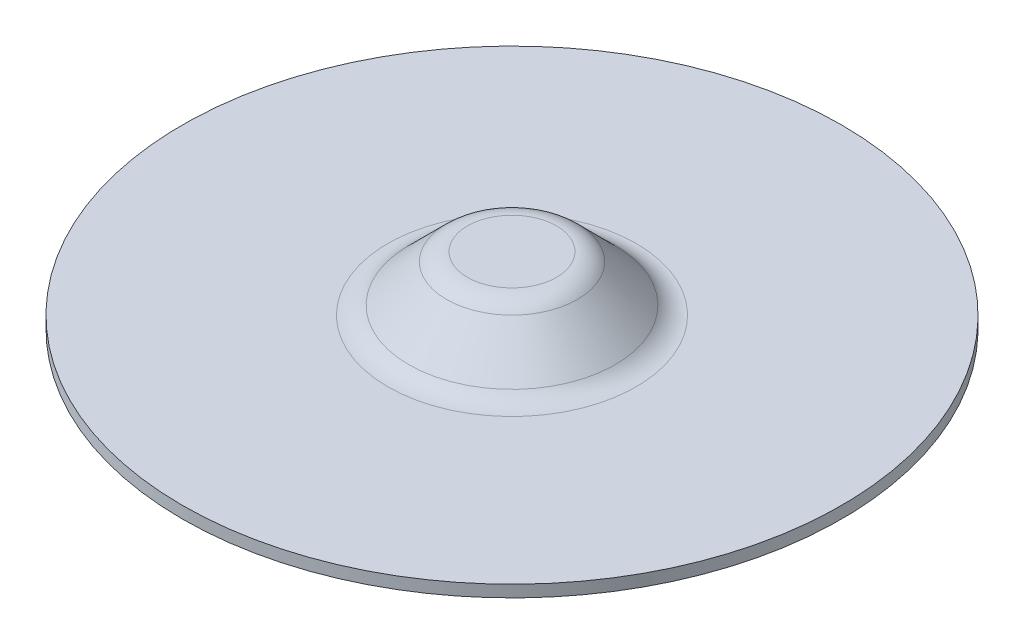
ISO-10303-21;
HEADER;
FILE_DESCRIPTION(('STEP AP214'),'2;1');
FILE_NAME('part.step','',(''),(''),'','','');
FILE_SCHEMA(('AUTOMOTIVE_DESIGN { 1 0 10303 214 1 1 1 1 }'));
ENDSEC;
DATA;
#1=APPLICATION_CONTEXT('core data for automotive mechanical design processes');
#2=APPLICATION_PROTOCOL_DEFINITION('international standard','automotive_design',2000,#1);
#3=PRODUCT_CONTEXT('',#1,'mechanical');
#4=PRODUCT('Part','Part','',(#3));
#5=PRODUCT_RELATED_PRODUCT_CATEGORY('part','',(#4));
#6=PRODUCT_DEFINITION_FORMATION('','',#4);
#7=PRODUCT_DEFINITION_CONTEXT('part definition',#1,'design');
#8=PRODUCT_DEFINITION('design','',#6,#7);
#9=PRODUCT_DEFINITION_SHAPE('','',#8);
#10=(LENGTH_UNIT() NAMED_UNIT(*) SI_UNIT(.MILLI.,.METRE.));
#11=(NAMED_UNIT(*) PLANE_ANGLE_UNIT() SI_UNIT($,.RADIAN.));
#12=(NAMED_UNIT(*) SI_UNIT($,.STERADIAN.) SOLID_ANGLE_UNIT());
#13=UNCERTAINTY_MEASURE_WITH_UNIT(LENGTH_MEASURE(1.E-05),#10,'distance_accuracy_value','');
#14=(GEOMETRIC_REPRESENTATION_CONTEXT(3) GLOBAL_UNCERTAINTY_ASSIGNED_CONTEXT((#13)) GLOBAL_UNIT_ASSIGNED_CONTEXT((#10,
#11,#12)) REPRESENTATION_CONTEXT('',''));
#15=CARTESIAN_POINT('',(0.,0.,0.));
#16=DIRECTION('',(0.,0.,1.));
#17=DIRECTION('',(1.,0.,0.));
#18=AXIS2_PLACEMENT_3D('',#15,#16,#17);
#19=CARTESIAN_POINT('',(0.,0.,0.));
#20=DIRECTION('',(0.,-1.,0.));
#21=DIRECTION('',(0.,0.,-1.));
#22=AXIS2_PLACEMENT_3D('',#19,#20,#21);
#23=PLANE('',#22);
#24=CARTESIAN_POINT('',(0.,0.,0.));
#25=DIRECTION('',(0.,-1.,0.));
#26=DIRECTION('',(0.,0.,1.));
#27=AXIS2_PLACEMENT_3D('',#24,#25,#26);
#28=CIRCLE('',#27,3.4346077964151);
#29=CARTESIAN_POINT('',(0.,0.,3.4346077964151));
#30=VERTEX_POINT('',#29);
#31=CARTESIAN_POINT('',(0.,0.,-3.4346077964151));
#32=VERTEX_POINT('',#31);
#33=EDGE_CURVE('E55',#30,#32,#28,.T.);
#34=ORIENTED_EDGE('',*,*,#33,.F.);
#35=CARTESIAN_POINT('',(0.,0.,0.));
#36=DIRECTION('',(0.,-1.,0.));
#37=DIRECTION('',(0.,0.,-1.));
#38=AXIS2_PLACEMENT_3D('',#35,#36,#37);
#39=CIRCLE('',#38,3.4346077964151);
#40=EDGE_CURVE('E57',#32,#30,#39,.T.);
#41=ORIENTED_EDGE('',*,*,#40,.F.);
#42=EDGE_LOOP('',(#34,#41));
#43=FACE_BOUND('',#42,.T.);
#44=ADVANCED_FACE('F18',(#43),#23,.F.);
#45=CARTESIAN_POINT('',(0.,-2.286,0.));
#46=DIRECTION('',(0.,1.,0.));
#47=DIRECTION('',(0.,0.,1.));
#48=AXIS2_PLACEMENT_3D('',#45,#46,#47);
#49=TOROIDAL_SURFACE('',#48,3.4346077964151,2.286);
#50=ORIENTED_EDGE('',*,*,#33,.T.);
#51=ORIENTED_EDGE('',*,*,#40,.T.);
#52=EDGE_LOOP('',(#50,#51));
#53=FACE_BOUND('',#52,.T.);
#54=CARTESIAN_POINT('',(0.,-0.669553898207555,0.));
#55=DIRECTION('',(0.,-1.,0.));
#56=DIRECTION('',(0.,0.,-1.));
#57=AXIS2_PLACEMENT_3D('',#54,#55,#56);
#58=CIRCLE('',#57,5.05105389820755);
#59=CARTESIAN_POINT('',(0.,-0.669553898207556,-5.05105389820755));
#60=VERTEX_POINT('',#59);
#61=EDGE_CURVE('E63',#60,#60,#58,.T.);
#62=ORIENTED_EDGE('',*,*,#61,.F.);
#63=EDGE_LOOP('',(#62));
#64=FACE_BOUND('',#63,.T.);
#65=ADVANCED_FACE('F59',(#53,#64),#49,.T.);
#66=CARTESIAN_POINT('',(0.,-3.57224610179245,0.));
#67=DIRECTION('',(0.,-1.,0.));
#68=DIRECTION('',(1.,0.,0.));
#69=AXIS2_PLACEMENT_3D('',#66,#67,#68);
#70=CONICAL_SURFACE('',#69,7.95374610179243,0.785398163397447);
#71=CARTESIAN_POINT('',(0.,-3.57224610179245,0.));
#72=DIRECTION('',(0.,1.,0.));
#73=DIRECTION('',(0.,0.,1.));
#74=AXIS2_PLACEMENT_3D('',#71,#72,#73);
#75=CIRCLE('',#74,7.95374610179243);
#76=CARTESIAN_POINT('',(0.,-3.57224610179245,7.95374610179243));
#77=VERTEX_POINT('',#76);
#78=EDGE_CURVE('E221',#77,#77,#75,.T.);
#79=ORIENTED_EDGE('',*,*,#78,.T.);
#80=EDGE_LOOP('',(#79));
#81=FACE_BOUND('',#80,.T.);
#82=ORIENTED_EDGE('',*,*,#61,.T.);
#83=EDGE_LOOP('',(#82));
#84=FACE_BOUND('',#83,.T.);
#85=ADVANCED_FACE('F89',(#81,#84),#70,.T.);
#86=CARTESIAN_POINT('',(0.,-0.9144,0.));
#87=DIRECTION('',(0.,1.,0.));
#88=DIRECTION('',(0.,0.,1.));
#89=AXIS2_PLACEMENT_3D('',#86,#87,#88);
#90=PLANE('',#89);
#91=CARTESIAN_POINT('',(0.,-0.9144,0.));
#92=DIRECTION('',(0.,1.,0.));
#93=DIRECTION('',(0.,0.,-1.));
#94=AXIS2_PLACEMENT_3D('',#91,#92,#93);
#95=CIRCLE('',#94,3.4346077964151);
#96=CARTESIAN_POINT('',(0.,-0.9144,3.4346077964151));
#97=VERTEX_POINT('',#96);
#98=CARTESIAN_POINT('',(0.,-0.9144,-3.4346077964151));
#99=VERTEX_POINT('',#98);
#100=EDGE_CURVE('E217',#97,#99,#95,.F.);
#101=ORIENTED_EDGE('',*,*,#100,.T.);
#102=CARTESIAN_POINT('',(0.,-0.9144,0.));
#103=DIRECTION('',(0.,1.,0.));
#104=DIRECTION('',(0.,0.,1.));
#105=AXIS2_PLACEMENT_3D('',#102,#103,#104);
#106=CIRCLE('',#105,3.4346077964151);
#107=EDGE_CURVE('E215',#99,#97,#106,.F.);
#108=ORIENTED_EDGE('',*,*,#107,.T.);
#109=EDGE_LOOP('',(#101,#108));
#110=FACE_BOUND('',#109,.T.);
#111=ADVANCED_FACE('F191',(#110),#90,.F.);
#112=CARTESIAN_POINT('',(0.,-1.9558,0.));
#113=DIRECTION('',(0.,1.,0.));
#114=DIRECTION('',(0.,0.,1.));
#115=AXIS2_PLACEMENT_3D('',#112,#113,#114);
#116=TOROIDAL_SURFACE('',#115,9.57019220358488,2.286);
#117=ORIENTED_EDGE('',*,*,#78,.F.);
#118=EDGE_LOOP('',(#117));
#119=FACE_BOUND('',#118,.T.);
#120=CARTESIAN_POINT('',(0.,-4.2418,0.));
#121=DIRECTION('',(0.,1.,0.));
#122=DIRECTION('',(0.,0.,-1.));
#123=AXIS2_PLACEMENT_3D('',#120,#121,#122);
#124=CIRCLE('',#123,9.57019220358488);
#125=CARTESIAN_POINT('',(0.,-4.2418,-9.57019220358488));
#126=VERTEX_POINT('',#125);
#127=CARTESIAN_POINT('',(0.,-4.2418,9.57019220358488));
#128=VERTEX_POINT('',#127);
#129=EDGE_CURVE('E150',#126,#128,#124,.T.);
#130=ORIENTED_EDGE('',*,*,#129,.T.);
#131=CARTESIAN_POINT('',(0.,-4.2418,0.));
#132=DIRECTION('',(0.,1.,0.));
#133=DIRECTION('',(0.,0.,1.));
#134=AXIS2_PLACEMENT_3D('',#131,#132,#133);
#135=CIRCLE('',#134,9.57019220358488);
#136=EDGE_CURVE('E182',#128,#126,#135,.T.);
#137=ORIENTED_EDGE('',*,*,#136,.T.);
#138=EDGE_LOOP('',(#130,#137));
#139=FACE_BOUND('',#138,.T.);
#140=ADVANCED_FACE('F188',(#119,#139),#116,.F.);
#141=CARTESIAN_POINT('',(0.,-2.286,0.));
#142=DIRECTION('',(0.,1.,0.));
#143=DIRECTION('',(0.,0.,1.));
#144=AXIS2_PLACEMENT_3D('',#141,#142,#143);
#145=TOROIDAL_SURFACE('',#144,3.4346077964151,1.3716);
#146=CARTESIAN_POINT('',(0.,-1.31613233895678,0.));
#147=DIRECTION('',(0.,-1.,0.));
#148=DIRECTION('',(0.,0.,-1.));
#149=AXIS2_PLACEMENT_3D('',#146,#147,#148);
#150=CIRCLE('',#149,4.40447545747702);
#151=CARTESIAN_POINT('',(0.,-1.31613233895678,-4.40447545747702));
#152=VERTEX_POINT('',#151);
#153=EDGE_CURVE('E107',#152,#152,#150,.T.);
#154=ORIENTED_EDGE('',*,*,#153,.T.);
#155=EDGE_LOOP('',(#154));
#156=FACE_BOUND('',#155,.T.);
#157=ORIENTED_EDGE('',*,*,#100,.F.);
#158=ORIENTED_EDGE('',*,*,#107,.F.);
#159=EDGE_LOOP('',(#157,#158));
#160=FACE_BOUND('',#159,.T.);
#161=ADVANCED_FACE('F167',(#156,#160),#145,.F.);
#162=CARTESIAN_POINT('',(9.57019220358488,-4.2418,0.));
#163=DIRECTION('',(0.,-1.,0.));
#164=DIRECTION('',(0.,0.,-1.));
#165=AXIS2_PLACEMENT_3D('',#162,#163,#164);
#166=PLANE('',#165);
#167=CARTESIAN_POINT('',(0.,-4.2418,0.));
#168=DIRECTION('',(0.,1.,0.));
#169=DIRECTION('',(0.,0.,1.));
#170=AXIS2_PLACEMENT_3D('',#167,#168,#169);
#171=CIRCLE('',#170,25.4);
#172=CARTESIAN_POINT('',(0.,-4.2418,25.4));
#173=VERTEX_POINT('',#172);
#174=EDGE_CURVE('E104',#173,#173,#171,.F.);
#175=ORIENTED_EDGE('',*,*,#174,.F.);
#176=EDGE_LOOP('',(#175));
#177=FACE_BOUND('',#176,.T.);
#178=ORIENTED_EDGE('',*,*,#129,.F.);
#179=ORIENTED_EDGE('',*,*,#136,.F.);
#180=EDGE_LOOP('',(#178,#179));
#181=FACE_BOUND('',#180,.T.);
#182=ADVANCED_FACE('F157',(#177,#181),#166,.F.);
#183=CARTESIAN_POINT('',(0.,-4.21882454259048,0.));
#184=DIRECTION('',(0.,-1.,0.));
#185=DIRECTION('',(0.,0.,-1.));
#186=AXIS2_PLACEMENT_3D('',#183,#184,#185);
#187=CONICAL_SURFACE('',#186,7.30716766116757,0.78539816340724);
#188=ORIENTED_EDGE('',*,*,#153,.F.);
#189=EDGE_LOOP('',(#188));
#190=FACE_BOUND('',#189,.T.);
#191=CARTESIAN_POINT('',(0.,-4.21882454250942,0.));
#192=DIRECTION('',(0.,1.,0.));
#193=DIRECTION('',(0.,0.,1.));
#194=AXIS2_PLACEMENT_3D('',#191,#192,#193);
#195=CIRCLE('',#194,7.30716766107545);
#196=CARTESIAN_POINT('',(0.,-4.21882454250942,7.30716766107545));
#197=VERTEX_POINT('',#196);
#198=EDGE_CURVE('E103',#197,#197,#195,.T.);
#199=ORIENTED_EDGE('',*,*,#198,.F.);
#200=EDGE_LOOP('',(#199));
#201=FACE_BOUND('',#200,.T.);
#202=ADVANCED_FACE('F166',(#190,#201),#187,.F.);
#203=CARTESIAN_POINT('',(0.,0.,0.));
#204=DIRECTION('',(0.,1.,0.));
#205=DIRECTION('',(0.,0.,1.));
#206=AXIS2_PLACEMENT_3D('',#203,#204,#205);
#207=CYLINDRICAL_SURFACE('',#206,25.4);
#208=ORIENTED_EDGE('',*,*,#174,.T.);
#209=EDGE_LOOP('',(#208));
#210=FACE_BOUND('',#209,.T.);
#211=CARTESIAN_POINT('',(0.,-5.1562,0.));
#212=DIRECTION('',(0.,1.,0.));
#213=DIRECTION('',(0.,0.,1.));
#214=AXIS2_PLACEMENT_3D('',#211,#212,#213);
#215=CIRCLE('',#214,25.4);
#216=CARTESIAN_POINT('',(0.,-5.1562,25.4));
#217=VERTEX_POINT('',#216);
#218=EDGE_CURVE('E95',#217,#217,#215,.T.);
#219=ORIENTED_EDGE('',*,*,#218,.T.);
#220=EDGE_LOOP('',(#219));
#221=FACE_BOUND('',#220,.T.);
#222=ADVANCED_FACE('F127',(#210,#221),#207,.T.);
#223=CARTESIAN_POINT('',(0.,-1.9558,0.));
#224=DIRECTION('',(0.,1.,0.));
#225=DIRECTION('',(0.,0.,1.));
#226=AXIS2_PLACEMENT_3D('',#223,#224,#225);
#227=TOROIDAL_SURFACE('',#226,9.57019220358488,3.2004);
#228=CARTESIAN_POINT('',(0.,-5.1562,0.));
#229=DIRECTION('',(0.,-1.,0.));
#230=DIRECTION('',(0.,0.,1.));
#231=AXIS2_PLACEMENT_3D('',#228,#229,#230);
#232=CIRCLE('',#231,9.57019220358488);
#233=CARTESIAN_POINT('',(0.,-5.1562,9.57019220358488));
#234=VERTEX_POINT('',#233);
#235=CARTESIAN_POINT('',(0.,-5.1562,-9.57019220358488));
#236=VERTEX_POINT('',#235);
#237=EDGE_CURVE('E29',#234,#236,#232,.T.);
#238=ORIENTED_EDGE('',*,*,#237,.T.);
#239=CARTESIAN_POINT('',(0.,-5.1562,0.));
#240=DIRECTION('',(0.,-1.,0.));
#241=DIRECTION('',(0.,0.,-1.));
#242=AXIS2_PLACEMENT_3D('',#239,#240,#241);
#243=CIRCLE('',#242,9.57019220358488);
#244=EDGE_CURVE('E11',#236,#234,#243,.T.);
#245=ORIENTED_EDGE('',*,*,#244,.T.);
#246=EDGE_LOOP('',(#238,#245));
#247=FACE_BOUND('',#246,.T.);
#248=ORIENTED_EDGE('',*,*,#198,.T.);
#249=EDGE_LOOP('',(#248));
#250=FACE_BOUND('',#249,.T.);
#251=ADVANCED_FACE('F115',(#247,#250),#227,.T.);
#252=CARTESIAN_POINT('',(9.57019220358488,-5.1562,0.));
#253=DIRECTION('',(0.,1.,0.));
#254=DIRECTION('',(0.,0.,1.));
#255=AXIS2_PLACEMENT_3D('',#252,#253,#254);
#256=PLANE('',#255);
#257=ORIENTED_EDGE('',*,*,#237,.F.);
#258=ORIENTED_EDGE('',*,*,#244,.F.);
#259=EDGE_LOOP('',(#257,#258));
#260=FACE_BOUND('',#259,.T.);
#261=ORIENTED_EDGE('',*,*,#218,.F.);
#262=EDGE_LOOP('',(#261));
#263=FACE_BOUND('',#262,.T.);
#264=ADVANCED_FACE('F126',(#260,#263),#256,.F.);
#265=CLOSED_SHELL('',(#44,#65,#85,#111,#140,#161,#182,#202,#222,#251,#264));
#266=MANIFOLD_SOLID_BREP('B1',#265);
#267=ADVANCED_BREP_SHAPE_REPRESENTATION('',(#18,#266),#14);
#268=SHAPE_DEFINITION_REPRESENTATION(#9,#267);
ENDSEC;
END-ISO-10303-21;
